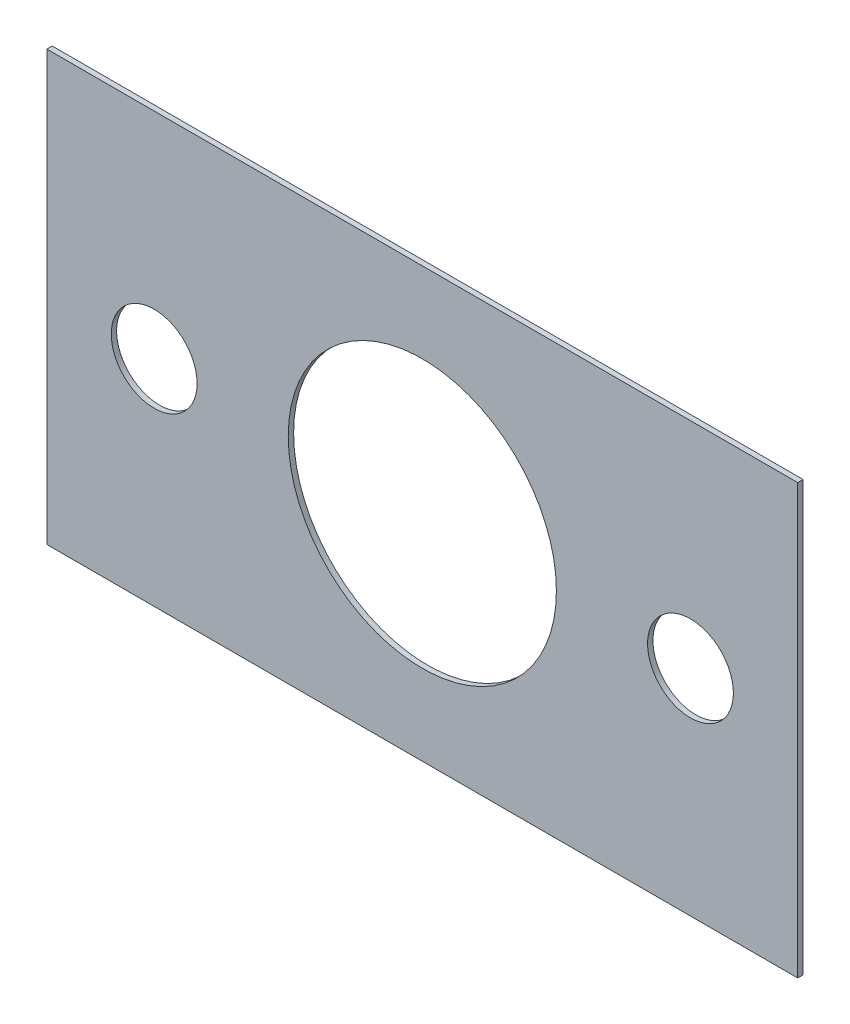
ISO-10303-21;
HEADER;
FILE_DESCRIPTION(('STEP AP214'),'2;1');
FILE_NAME('part.step','',(''),(''),'','','');
FILE_SCHEMA(('AUTOMOTIVE_DESIGN { 1 0 10303 214 1 1 1 1 }'));
ENDSEC;
DATA;
#1=APPLICATION_CONTEXT('core data for automotive mechanical design processes');
#2=APPLICATION_PROTOCOL_DEFINITION('international standard','automotive_design',2000,#1);
#3=PRODUCT_CONTEXT('',#1,'mechanical');
#4=PRODUCT('Part','Part','',(#3));
#5=PRODUCT_RELATED_PRODUCT_CATEGORY('part','',(#4));
#6=PRODUCT_DEFINITION_FORMATION('','',#4);
#7=PRODUCT_DEFINITION_CONTEXT('part definition',#1,'design');
#8=PRODUCT_DEFINITION('design','',#6,#7);
#9=PRODUCT_DEFINITION_SHAPE('','',#8);
#10=(LENGTH_UNIT() NAMED_UNIT(*) SI_UNIT(.MILLI.,.METRE.));
#11=(NAMED_UNIT(*) PLANE_ANGLE_UNIT() SI_UNIT($,.RADIAN.));
#12=(NAMED_UNIT(*) SI_UNIT($,.STERADIAN.) SOLID_ANGLE_UNIT());
#13=UNCERTAINTY_MEASURE_WITH_UNIT(LENGTH_MEASURE(1.E-05),#10,'distance_accuracy_value','');
#14=(GEOMETRIC_REPRESENTATION_CONTEXT(3) GLOBAL_UNCERTAINTY_ASSIGNED_CONTEXT((#13)) GLOBAL_UNIT_ASSIGNED_CONTEXT((#10,
#11,#12)) REPRESENTATION_CONTEXT('',''));
#15=CARTESIAN_POINT('',(0.,0.,0.));
#16=DIRECTION('',(0.,0.,1.));
#17=DIRECTION('',(1.,0.,0.));
#18=AXIS2_PLACEMENT_3D('',#15,#16,#17);
#19=CARTESIAN_POINT('',(-35.,-20.,0.5));
#20=DIRECTION('',(0.,0.,1.));
#21=DIRECTION('',(1.,0.,0.));
#22=AXIS2_PLACEMENT_3D('',#19,#20,#21);
#23=PLANE('',#22);
#24=CARTESIAN_POINT('',(-25.,0.,0.5));
#25=DIRECTION('',(0.,0.,1.));
#26=DIRECTION('',(1.,0.,0.));
#27=AXIS2_PLACEMENT_3D('',#24,#25,#26);
#28=CIRCLE('',#27,4.);
#29=CARTESIAN_POINT('',(-21.,0.,0.5));
#30=VERTEX_POINT('',#29);
#31=EDGE_CURVE('E112',#30,#30,#28,.T.);
#32=ORIENTED_EDGE('',*,*,#31,.F.);
#33=EDGE_LOOP('',(#32));
#34=FACE_BOUND('',#33,.T.);
#35=DIRECTION('',(0.,-1.,0.));
#36=VECTOR('',#35,1.);
#37=CARTESIAN_POINT('',(-35.,20.,0.5));
#38=LINE('',#37,#36);
#39=CARTESIAN_POINT('',(-35.,20.,0.5));
#40=VERTEX_POINT('',#39);
#41=CARTESIAN_POINT('',(-35.,-20.,0.5));
#42=VERTEX_POINT('',#41);
#43=EDGE_CURVE('E82',#40,#42,#38,.T.);
#44=ORIENTED_EDGE('',*,*,#43,.T.);
#45=DIRECTION('',(1.,0.,0.));
#46=VECTOR('',#45,1.);
#47=CARTESIAN_POINT('',(-35.,-20.,0.5));
#48=LINE('',#47,#46);
#49=CARTESIAN_POINT('',(35.,-20.,0.5));
#50=VERTEX_POINT('',#49);
#51=EDGE_CURVE('E77',#42,#50,#48,.T.);
#52=ORIENTED_EDGE('',*,*,#51,.T.);
#53=DIRECTION('',(0.,1.,0.));
#54=VECTOR('',#53,1.);
#55=CARTESIAN_POINT('',(35.,20.,0.5));
#56=LINE('',#55,#54);
#57=CARTESIAN_POINT('',(35.,20.,0.5));
#58=VERTEX_POINT('',#57);
#59=EDGE_CURVE('E80',#50,#58,#56,.T.);
#60=ORIENTED_EDGE('',*,*,#59,.T.);
#61=DIRECTION('',(-1.,0.,0.));
#62=VECTOR('',#61,1.);
#63=CARTESIAN_POINT('',(-35.,20.,0.5));
#64=LINE('',#63,#62);
#65=EDGE_CURVE('E47',#58,#40,#64,.T.);
#66=ORIENTED_EDGE('',*,*,#65,.T.);
#67=EDGE_LOOP('',(#44,#52,#60,#66));
#68=FACE_BOUND('',#67,.T.);
#69=CARTESIAN_POINT('',(0.,0.,0.5));
#70=DIRECTION('',(0.,0.,1.));
#71=DIRECTION('',(1.,0.,0.));
#72=AXIS2_PLACEMENT_3D('',#69,#70,#71);
#73=CIRCLE('',#72,12.5);
#74=CARTESIAN_POINT('',(12.5,0.,0.5));
#75=VERTEX_POINT('',#74);
#76=EDGE_CURVE('E97',#75,#75,#73,.T.);
#77=ORIENTED_EDGE('',*,*,#76,.F.);
#78=EDGE_LOOP('',(#77));
#79=FACE_BOUND('',#78,.T.);
#80=CARTESIAN_POINT('',(25.,0.,0.5));
#81=DIRECTION('',(0.,0.,1.));
#82=DIRECTION('',(1.,0.,0.));
#83=AXIS2_PLACEMENT_3D('',#80,#81,#82);
#84=CIRCLE('',#83,4.);
#85=CARTESIAN_POINT('',(29.,0.,0.5));
#86=VERTEX_POINT('',#85);
#87=EDGE_CURVE('E118',#86,#86,#84,.T.);
#88=ORIENTED_EDGE('',*,*,#87,.F.);
#89=EDGE_LOOP('',(#88));
#90=FACE_BOUND('',#89,.T.);
#91=ADVANCED_FACE('F30',(#34,#68,#79,#90),#23,.T.);
#92=CARTESIAN_POINT('',(-35.,-20.,0.));
#93=DIRECTION('',(0.,0.,1.));
#94=DIRECTION('',(1.,0.,0.));
#95=AXIS2_PLACEMENT_3D('',#92,#93,#94);
#96=PLANE('',#95);
#97=CARTESIAN_POINT('',(-25.,0.,0.));
#98=DIRECTION('',(0.,0.,1.));
#99=DIRECTION('',(1.,0.,0.));
#100=AXIS2_PLACEMENT_3D('',#97,#98,#99);
#101=CIRCLE('',#100,4.);
#102=CARTESIAN_POINT('',(-21.,0.,0.));
#103=VERTEX_POINT('',#102);
#104=EDGE_CURVE('E115',#103,#103,#101,.T.);
#105=ORIENTED_EDGE('',*,*,#104,.T.);
#106=EDGE_LOOP('',(#105));
#107=FACE_BOUND('',#106,.T.);
#108=DIRECTION('',(0.,-1.,0.));
#109=VECTOR('',#108,1.);
#110=CARTESIAN_POINT('',(-35.,20.,0.));
#111=LINE('',#110,#109);
#112=CARTESIAN_POINT('',(-35.,20.,0.));
#113=VERTEX_POINT('',#112);
#114=CARTESIAN_POINT('',(-35.,-20.,0.));
#115=VERTEX_POINT('',#114);
#116=EDGE_CURVE('E94',#113,#115,#111,.T.);
#117=ORIENTED_EDGE('',*,*,#116,.F.);
#118=DIRECTION('',(-1.,0.,0.));
#119=VECTOR('',#118,1.);
#120=CARTESIAN_POINT('',(-35.,20.,0.));
#121=LINE('',#120,#119);
#122=CARTESIAN_POINT('',(35.,20.,0.));
#123=VERTEX_POINT('',#122);
#124=EDGE_CURVE('E70',#123,#113,#121,.T.);
#125=ORIENTED_EDGE('',*,*,#124,.F.);
#126=DIRECTION('',(0.,1.,0.));
#127=VECTOR('',#126,1.);
#128=CARTESIAN_POINT('',(35.,20.,0.));
#129=LINE('',#128,#127);
#130=CARTESIAN_POINT('',(35.,-20.,0.));
#131=VERTEX_POINT('',#130);
#132=EDGE_CURVE('E64',#131,#123,#129,.T.);
#133=ORIENTED_EDGE('',*,*,#132,.F.);
#134=DIRECTION('',(1.,0.,0.));
#135=VECTOR('',#134,1.);
#136=CARTESIAN_POINT('',(-35.,-20.,0.));
#137=LINE('',#136,#135);
#138=EDGE_CURVE('E86',#115,#131,#137,.T.);
#139=ORIENTED_EDGE('',*,*,#138,.F.);
#140=EDGE_LOOP('',(#117,#125,#133,#139));
#141=FACE_BOUND('',#140,.T.);
#142=CARTESIAN_POINT('',(0.,0.,0.));
#143=DIRECTION('',(0.,0.,1.));
#144=DIRECTION('',(1.,0.,0.));
#145=AXIS2_PLACEMENT_3D('',#142,#143,#144);
#146=CIRCLE('',#145,12.5);
#147=CARTESIAN_POINT('',(12.5,0.,0.));
#148=VERTEX_POINT('',#147);
#149=EDGE_CURVE('E109',#148,#148,#146,.T.);
#150=ORIENTED_EDGE('',*,*,#149,.T.);
#151=EDGE_LOOP('',(#150));
#152=FACE_BOUND('',#151,.T.);
#153=CARTESIAN_POINT('',(25.,0.,0.));
#154=DIRECTION('',(0.,0.,1.));
#155=DIRECTION('',(1.,0.,0.));
#156=AXIS2_PLACEMENT_3D('',#153,#154,#155);
#157=CIRCLE('',#156,4.);
#158=CARTESIAN_POINT('',(29.,0.,0.));
#159=VERTEX_POINT('',#158);
#160=EDGE_CURVE('E121',#159,#159,#157,.T.);
#161=ORIENTED_EDGE('',*,*,#160,.T.);
#162=EDGE_LOOP('',(#161));
#163=FACE_BOUND('',#162,.T.);
#164=ADVANCED_FACE('F105',(#107,#141,#152,#163),#96,.F.);
#165=CARTESIAN_POINT('',(-35.,20.,0.5));
#166=DIRECTION('',(1.,0.,0.));
#167=DIRECTION('',(0.,1.,0.));
#168=AXIS2_PLACEMENT_3D('',#165,#166,#167);
#169=PLANE('',#168);
#170=ORIENTED_EDGE('',*,*,#116,.T.);
#171=DIRECTION('',(0.,0.,-1.));
#172=VECTOR('',#171,1.);
#173=CARTESIAN_POINT('',(-35.,-20.,0.5));
#174=LINE('',#173,#172);
#175=EDGE_CURVE('E11',#42,#115,#174,.T.);
#176=ORIENTED_EDGE('',*,*,#175,.F.);
#177=ORIENTED_EDGE('',*,*,#43,.F.);
#178=DIRECTION('',(0.,0.,-1.));
#179=VECTOR('',#178,1.);
#180=CARTESIAN_POINT('',(-35.,20.,0.5));
#181=LINE('',#180,#179);
#182=EDGE_CURVE('E90',#40,#113,#181,.T.);
#183=ORIENTED_EDGE('',*,*,#182,.T.);
#184=EDGE_LOOP('',(#170,#176,#177,#183));
#185=FACE_BOUND('',#184,.T.);
#186=ADVANCED_FACE('F32',(#185),#169,.F.);
#187=CARTESIAN_POINT('',(-35.,-20.,0.5));
#188=DIRECTION('',(0.,1.,0.));
#189=DIRECTION('',(0.,0.,1.));
#190=AXIS2_PLACEMENT_3D('',#187,#188,#189);
#191=PLANE('',#190);
#192=ORIENTED_EDGE('',*,*,#138,.T.);
#193=DIRECTION('',(0.,0.,-1.));
#194=VECTOR('',#193,1.);
#195=CARTESIAN_POINT('',(35.,-20.,0.5));
#196=LINE('',#195,#194);
#197=EDGE_CURVE('E39',#50,#131,#196,.T.);
#198=ORIENTED_EDGE('',*,*,#197,.F.);
#199=ORIENTED_EDGE('',*,*,#51,.F.);
#200=ORIENTED_EDGE('',*,*,#175,.T.);
#201=EDGE_LOOP('',(#192,#198,#199,#200));
#202=FACE_BOUND('',#201,.T.);
#203=ADVANCED_FACE('F85',(#202),#191,.F.);
#204=CARTESIAN_POINT('',(35.,20.,0.5));
#205=DIRECTION('',(-1.,0.,0.));
#206=DIRECTION('',(0.,-1.,0.));
#207=AXIS2_PLACEMENT_3D('',#204,#205,#206);
#208=PLANE('',#207);
#209=ORIENTED_EDGE('',*,*,#132,.T.);
#210=DIRECTION('',(0.,0.,-1.));
#211=VECTOR('',#210,1.);
#212=CARTESIAN_POINT('',(35.,20.,0.5));
#213=LINE('',#212,#211);
#214=EDGE_CURVE('E87',#58,#123,#213,.T.);
#215=ORIENTED_EDGE('',*,*,#214,.F.);
#216=ORIENTED_EDGE('',*,*,#59,.F.);
#217=ORIENTED_EDGE('',*,*,#197,.T.);
#218=EDGE_LOOP('',(#209,#215,#216,#217));
#219=FACE_BOUND('',#218,.T.);
#220=ADVANCED_FACE('F88',(#219),#208,.F.);
#221=CARTESIAN_POINT('',(-35.,20.,0.5));
#222=DIRECTION('',(0.,-1.,0.));
#223=DIRECTION('',(0.,0.,-1.));
#224=AXIS2_PLACEMENT_3D('',#221,#222,#223);
#225=PLANE('',#224);
#226=ORIENTED_EDGE('',*,*,#124,.T.);
#227=ORIENTED_EDGE('',*,*,#182,.F.);
#228=ORIENTED_EDGE('',*,*,#65,.F.);
#229=ORIENTED_EDGE('',*,*,#214,.T.);
#230=EDGE_LOOP('',(#226,#227,#228,#229));
#231=FACE_BOUND('',#230,.T.);
#232=ADVANCED_FACE('F102',(#231),#225,.F.);
#233=CARTESIAN_POINT('',(0.,0.,0.5));
#234=DIRECTION('',(0.,0.,-1.));
#235=DIRECTION('',(-1.,0.,0.));
#236=AXIS2_PLACEMENT_3D('',#233,#234,#235);
#237=CYLINDRICAL_SURFACE('',#236,12.5);
#238=ORIENTED_EDGE('',*,*,#76,.T.);
#239=EDGE_LOOP('',(#238));
#240=FACE_BOUND('',#239,.T.);
#241=ORIENTED_EDGE('',*,*,#149,.F.);
#242=EDGE_LOOP('',(#241));
#243=FACE_BOUND('',#242,.T.);
#244=ADVANCED_FACE('F140',(#240,#243),#237,.F.);
#245=CARTESIAN_POINT('',(-25.,0.,0.5));
#246=DIRECTION('',(0.,0.,-1.));
#247=DIRECTION('',(-1.,0.,0.));
#248=AXIS2_PLACEMENT_3D('',#245,#246,#247);
#249=CYLINDRICAL_SURFACE('',#248,4.);
#250=ORIENTED_EDGE('',*,*,#31,.T.);
#251=EDGE_LOOP('',(#250));
#252=FACE_BOUND('',#251,.T.);
#253=ORIENTED_EDGE('',*,*,#104,.F.);
#254=EDGE_LOOP('',(#253));
#255=FACE_BOUND('',#254,.T.);
#256=ADVANCED_FACE('F186',(#252,#255),#249,.F.);
#257=CARTESIAN_POINT('',(25.,0.,0.5));
#258=DIRECTION('',(0.,0.,-1.));
#259=DIRECTION('',(-1.,0.,0.));
#260=AXIS2_PLACEMENT_3D('',#257,#258,#259);
#261=CYLINDRICAL_SURFACE('',#260,4.);
#262=ORIENTED_EDGE('',*,*,#87,.T.);
#263=EDGE_LOOP('',(#262));
#264=FACE_BOUND('',#263,.T.);
#265=ORIENTED_EDGE('',*,*,#160,.F.);
#266=EDGE_LOOP('',(#265));
#267=FACE_BOUND('',#266,.T.);
#268=ADVANCED_FACE('F127',(#264,#267),#261,.F.);
#269=CLOSED_SHELL('',(#91,#164,#186,#203,#220,#232,#244,#256,#268));
#270=MANIFOLD_SOLID_BREP('B2',#269);
#271=ADVANCED_BREP_SHAPE_REPRESENTATION('',(#18,#270),#14);
#272=SHAPE_DEFINITION_REPRESENTATION(#9,#271);
ENDSEC;
END-ISO-10303-21;
